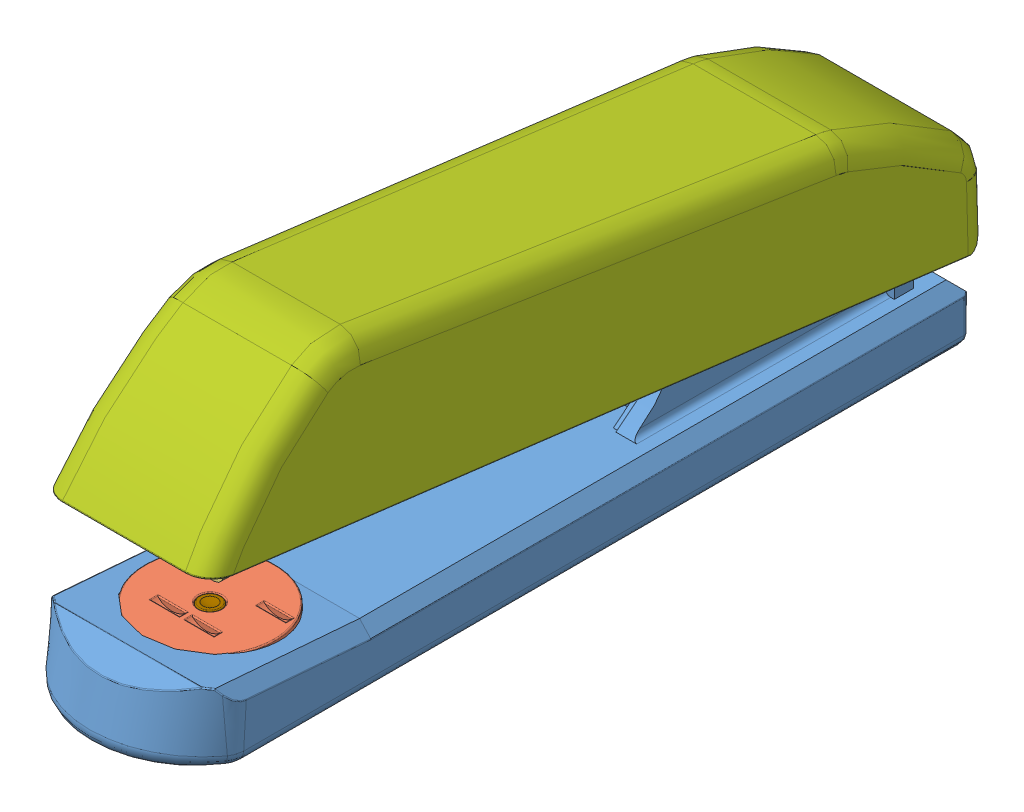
SolidWorks assembly Stapler.SLDASM, configuration Default (file format 3400). Lengths in mm.
Overall size (41.3 66.48 177.35).
10 component instances, 10 part files, 24 mates.
Components (placement in the parent):
- Stapler Base-1: Stapler Base.SLDPRT [Default] at origin size (40.21 32.13 169.75)
- Staple Plate-1: Staple Plate.SLDPRT [Default] at (0 12.192 142.748) size (27.94 3.13 27.94)
- Staple Holder bottom-1: Staple Holder bottom.SLDPRT [Default] at (-0.127 18.5683 7.868) x (1 0 0) z (0 0.031657 0.999499) size (15.49 16.26 146.43)
- Staple Holder Top-3: Staple Holder Top.SLDPRT [Default] at (-0.1143 33.9276 7.3815) x (1 0 0) z (0 0.031657 0.999499) size (12.83 13.72 146.94)
- Stapler Hinge Bushing-1: Stapler Hinge Bushing.SLDPRT [Default] at (-0.1016 25.2959 7.6549) x (1 0 0) z (0 0.828849 0.559472) size (10.16 10.87 10.87)
- Stapler Hinge Pin-1: Stapler Hinge Pin.SLDPRT [Default] at (-0.127 25.2959 7.6549) x (0 1 0) z (0 0 1) size (5.08 36.83 5.08)
- Stapler Top Cover-1: Stapler Top Cover.SLDPRT [Default] at (-0.127 16.3133 -4.4424) x (1 0 0) z (0 0.111667 0.993746) size (41.3 31.82 166.53)
- Stapler Eject Bracket-1: Stapler Eject Bracket.SLDPRT [Default] at (-0.127 46.6102 124.1493) x (1 0 0) z (0 -0.111667 -0.993746) size (12.83 21.59 22.86)
- plate holder-1: plate holder.SLDPRT [Default] at (0 13.208 142.748) x (0.542732 0 -0.839906) z (0.839906 0 0.542732) size (6.35 10.92 6.35)
- Staple Guide-1: Staple Guide.SLDPRT [Default] at (-0.127 29.8131 146.2654) x (-1 0 0) z (0 -0.031657 -0.999499) size (10.41 5.59 132.84)
Mates (geometry in assembly coordinates):
- Concentric4: concentric anti-aligned: circle of Stapler Base-1; circle of Staple Plate-1
- Coincident7: coincident anti-aligned: plane of Stapler Base-1 through (0 12.192 142.748) normal (0 1 0); plane of Staple Plate-1 through (0 12.192 142.748) normal (0 -1 0)
- Parallel1: parallel aligned: plane of Stapler Base-1 through (19.8464 12.192 60.1607) normal (0 0 1); plane of Staple Plate-1 through (8.763 17.018 136.906) normal (0 0 1)
- Concentric5: concentric aligned: circle of Stapler Base-1; circle of Staple Holder bottom-1
- Distance1: distance = 2.54 mm anti-aligned: plane of Stapler Base-1 through (10.16 33.9142 79.2395) normal (-1 0 0); plane of Staple Holder bottom-1 through (7.62 22.9907 147.4979) normal (1 0 0)
- Concentric6: concentric anti-aligned: circle of Staple Holder Top-3; circle of Staple Holder bottom-1
- Distance9: distance = 0.0762 mm anti-aligned: plane of Staple Holder bottom-1 through (-6.604 34.415 147.1361) normal (1 0 0); plane of Staple Holder Top-3 through (-6.5278 38.35 147.0115) normal (-1 0 0)
- Concentric7: concentric anti-aligned: cylinder of Stapler Base-1; cylinder of Stapler Hinge Pin-1
- Distance3: distance = 2.921 mm aligned: plane of Stapler Base-1 through (15.367 25.2959 7.6549) normal (1 0 0); plane of Stapler Hinge Pin-1 through (18.288 25.2959 7.6549) normal (1 0 0)
- Concentric8: concentric anti-aligned: circle of Stapler Hinge Pin-1; cylinder of Stapler Top Cover-1
- Coincident18: coincident anti-aligned: plane of Stapler Hinge Pin-1 through (-18.542 25.2959 7.6549) normal (-1 0 0); plane of Stapler Top Cover-1 through (-18.542 25.2959 7.6549) normal (1 0 0)
- Coincident23: coincident aligned: circle of Staple Plate-1; cylinder of plate holder-1
- Coincident24: coincident anti-aligned: plane of Staple Plate-1 through (0 13.208 142.748) normal (0 1 0); plane of plate holder-1 through (0 13.208 142.748) normal (0 -1 0)
- Coincident27: coincident anti-aligned: plane of Stapler Top Cover-1 through (-6.5405 46.6102 124.1493) normal (0 -0.993746 0.111667); plane of Stapler Eject Bracket-1 through (-6.5405 49.1629 146.8663) normal (0 0.993746 -0.111667)
- Coincident28: coincident anti-aligned: plane of Stapler Top Cover-1 through (-6.5405 46.6102 124.1493) normal (0 0.111667 0.993746); plane of Stapler Eject Bracket-1 through (-6.5405 45.3482 124.2911) normal (0 -0.111667 -0.993746)
- Coincident29: coincident anti-aligned: plane of Stapler Top Cover-1 through (6.2865 49.1629 146.8663) normal (-1 0 0); plane of Stapler Eject Bracket-1 through (6.2865 45.3482 124.2911) normal (1 0 0)
- Concentric9: concentric anti-aligned: cylinder of Stapler Hinge Bushing-1; cylinder of Stapler Hinge Pin-1
- Distance7: distance = 0.1778 mm anti-aligned: plane of Staple Holder Top-3 through (5.1562 38.35 147.0115) normal (-1 0 0); plane of Stapler Hinge Bushing-1 through (4.9784 25.2959 7.6549) normal (1 0 0)
- Coincident38: coincident aligned: plane of Staple Holder bottom-1 through (-7.874 24.2279 146.4422) normal (0 0.031657 0.999499); plane of Staple Guide-1 through (-4.2672 27.9853 146.3232) normal (0 0.031657 0.999499)
- Coincident39: coincident anti-aligned: plane of Staple Holder bottom-1 through (-7.874 24.2601 147.4577) normal (0 0.999499 -0.031657); plane of Staple Guide-1 through (-5.334 20.0226 13.6668) normal (0 -0.999499 0.031657)
- Distance8: distance = 1.27 mm anti-aligned: plane of Staple Holder bottom-1 through (-6.604 34.415 147.1361) normal (1 0 0); plane of Staple Guide-1 through (-5.334 25.6078 13.4899) normal (-1 0 0)
- LimitAngle4: limit planar angle = 0.1119 rad aligned: plane of Stapler Base-1 through (-19.812 12.192 128.016) normal (0 1 0); plane of Stapler Top Cover-1 through (20.193 16.3133 -4.4424) normal (0 -0.993746 0.111667)
- LimitAngle14: limit planar angle = 0.080238 rad aligned: plane of Staple Holder Top-3 through (-6.5278 38.35 147.0115) normal (0 0.999499 -0.031657); plane of Stapler Top Cover-1 through (-6.8806 43.7401 121.3538) normal (0 -0.993746 0.111667)
- LimitAngle15: limit planar angle = 0 rad aligned: unknown of Staple Holder Top-3; unknown of Staple Guide-1
